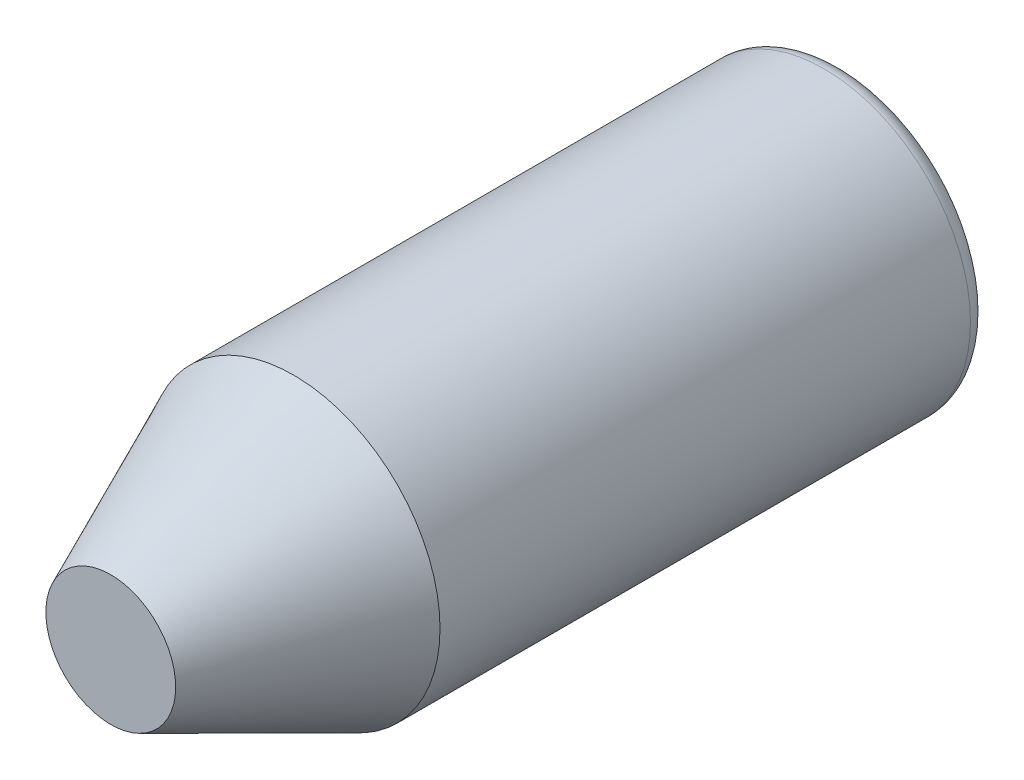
ISO-10303-21;
HEADER;
FILE_DESCRIPTION(('STEP AP214'),'2;1');
FILE_NAME('part.step','',(''),(''),'','','');
FILE_SCHEMA(('AUTOMOTIVE_DESIGN { 1 0 10303 214 1 1 1 1 }'));
ENDSEC;
DATA;
#1=APPLICATION_CONTEXT('core data for automotive mechanical design processes');
#2=APPLICATION_PROTOCOL_DEFINITION('international standard','automotive_design',2000,#1);
#3=PRODUCT_CONTEXT('',#1,'mechanical');
#4=PRODUCT('Part','Part','',(#3));
#5=PRODUCT_RELATED_PRODUCT_CATEGORY('part','',(#4));
#6=PRODUCT_DEFINITION_FORMATION('','',#4);
#7=PRODUCT_DEFINITION_CONTEXT('part definition',#1,'design');
#8=PRODUCT_DEFINITION('design','',#6,#7);
#9=PRODUCT_DEFINITION_SHAPE('','',#8);
#10=(LENGTH_UNIT() NAMED_UNIT(*) SI_UNIT(.MILLI.,.METRE.));
#11=(NAMED_UNIT(*) PLANE_ANGLE_UNIT() SI_UNIT($,.RADIAN.));
#12=(NAMED_UNIT(*) SI_UNIT($,.STERADIAN.) SOLID_ANGLE_UNIT());
#13=UNCERTAINTY_MEASURE_WITH_UNIT(LENGTH_MEASURE(1.E-05),#10,'distance_accuracy_value','');
#14=(GEOMETRIC_REPRESENTATION_CONTEXT(3) GLOBAL_UNCERTAINTY_ASSIGNED_CONTEXT((#13)) GLOBAL_UNIT_ASSIGNED_CONTEXT((#10,
#11,#12)) REPRESENTATION_CONTEXT('',''));
#15=CARTESIAN_POINT('',(0.,0.,0.));
#16=DIRECTION('',(0.,0.,1.));
#17=DIRECTION('',(1.,0.,0.));
#18=AXIS2_PLACEMENT_3D('',#15,#16,#17);
#19=CARTESIAN_POINT('',(0.,0.,200.));
#20=DIRECTION('',(0.,0.,1.));
#21=DIRECTION('',(1.,0.,0.));
#22=AXIS2_PLACEMENT_3D('',#19,#20,#21);
#23=PLANE('',#22);
#24=CARTESIAN_POINT('',(0.,0.,200.));
#25=DIRECTION('',(0.,0.,1.));
#26=DIRECTION('',(1.,0.,0.));
#27=AXIS2_PLACEMENT_3D('',#24,#25,#26);
#28=CIRCLE('',#27,17.7385657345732);
#29=CARTESIAN_POINT('',(17.7385657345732,0.,200.));
#30=VERTEX_POINT('',#29);
#31=EDGE_CURVE('E49',#30,#30,#28,.T.);
#32=ORIENTED_EDGE('',*,*,#31,.T.);
#33=EDGE_LOOP('',(#32));
#34=FACE_BOUND('',#33,.T.);
#35=ADVANCED_FACE('F34',(#34),#23,.T.);
#36=CARTESIAN_POINT('',(0.,0.,150.));
#37=DIRECTION('',(0.,0.,-1.));
#38=DIRECTION('',(-1.,0.,0.));
#39=AXIS2_PLACEMENT_3D('',#36,#37,#38);
#40=CYLINDRICAL_SURFACE('',#39,40.);
#41=CARTESIAN_POINT('',(0.,0.,5.));
#42=DIRECTION('',(0.,0.,1.));
#43=DIRECTION('',(1.,0.,0.));
#44=AXIS2_PLACEMENT_3D('',#41,#42,#43);
#45=CIRCLE('',#44,40.);
#46=CARTESIAN_POINT('',(40.,0.,5.));
#47=VERTEX_POINT('',#46);
#48=EDGE_CURVE('E41',#47,#47,#45,.T.);
#49=ORIENTED_EDGE('',*,*,#48,.T.);
#50=EDGE_LOOP('',(#49));
#51=FACE_BOUND('',#50,.T.);
#52=CARTESIAN_POINT('',(0.,0.,150.));
#53=DIRECTION('',(0.,0.,1.));
#54=DIRECTION('',(1.,0.,0.));
#55=AXIS2_PLACEMENT_3D('',#52,#53,#54);
#56=CIRCLE('',#55,40.);
#57=CARTESIAN_POINT('',(40.,0.,150.));
#58=VERTEX_POINT('',#57);
#59=EDGE_CURVE('E45',#58,#58,#56,.T.);
#60=ORIENTED_EDGE('',*,*,#59,.F.);
#61=EDGE_LOOP('',(#60));
#62=FACE_BOUND('',#61,.T.);
#63=ADVANCED_FACE('F62',(#51,#62),#40,.T.);
#64=CARTESIAN_POINT('',(0.,0.,0.));
#65=DIRECTION('',(0.,0.,1.));
#66=DIRECTION('',(1.,0.,0.));
#67=AXIS2_PLACEMENT_3D('',#64,#65,#66);
#68=PLANE('',#67);
#69=CARTESIAN_POINT('',(0.,0.,0.));
#70=DIRECTION('',(0.,0.,1.));
#71=DIRECTION('',(1.,0.,0.));
#72=AXIS2_PLACEMENT_3D('',#69,#70,#71);
#73=CIRCLE('',#72,35.);
#74=CARTESIAN_POINT('',(35.,0.,0.));
#75=VERTEX_POINT('',#74);
#76=EDGE_CURVE('E11',#75,#75,#73,.F.);
#77=ORIENTED_EDGE('',*,*,#76,.T.);
#78=EDGE_LOOP('',(#77));
#79=FACE_BOUND('',#78,.T.);
#80=ADVANCED_FACE('F64',(#79),#68,.F.);
#81=CARTESIAN_POINT('',(0.,0.,5.));
#82=DIRECTION('',(0.,0.,1.));
#83=DIRECTION('',(1.,0.,0.));
#84=AXIS2_PLACEMENT_3D('',#81,#82,#83);
#85=TOROIDAL_SURFACE('',#84,35.,5.);
#86=ORIENTED_EDGE('',*,*,#76,.F.);
#87=EDGE_LOOP('',(#86));
#88=FACE_BOUND('',#87,.T.);
#89=ORIENTED_EDGE('',*,*,#48,.F.);
#90=EDGE_LOOP('',(#89));
#91=FACE_BOUND('',#90,.T.);
#92=ADVANCED_FACE('F36',(#88,#91),#85,.T.);
#93=CARTESIAN_POINT('',(0.,0.,150.));
#94=DIRECTION('',(0.,0.,-1.));
#95=DIRECTION('',(1.,0.,0.));
#96=AXIS2_PLACEMENT_3D('',#93,#94,#95);
#97=CONICAL_SURFACE('',#96,40.,0.418879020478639);
#98=ORIENTED_EDGE('',*,*,#31,.F.);
#99=EDGE_LOOP('',(#98));
#100=FACE_BOUND('',#99,.T.);
#101=ORIENTED_EDGE('',*,*,#59,.T.);
#102=EDGE_LOOP('',(#101));
#103=FACE_BOUND('',#102,.T.);
#104=ADVANCED_FACE('F56',(#100,#103),#97,.T.);
#105=CLOSED_SHELL('',(#35,#63,#80,#92,#104));
#106=MANIFOLD_SOLID_BREP('B2',#105);
#107=ADVANCED_BREP_SHAPE_REPRESENTATION('',(#18,#106),#14);
#108=SHAPE_DEFINITION_REPRESENTATION(#9,#107);
ENDSEC;
END-ISO-10303-21;
